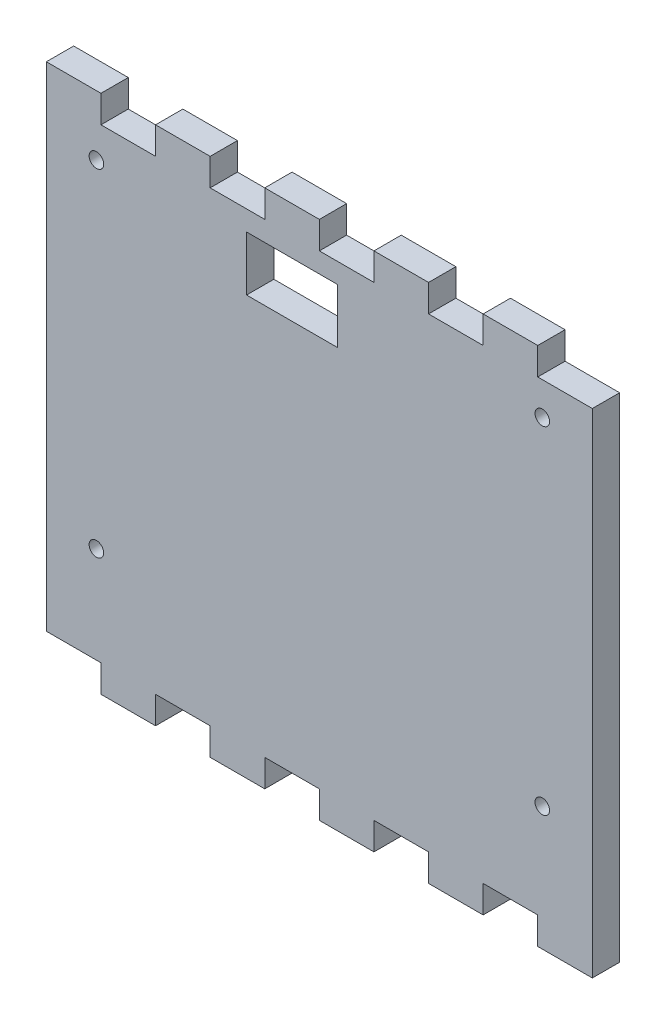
ISO-10303-21;
HEADER;
FILE_DESCRIPTION(('STEP AP214'),'2;1');
FILE_NAME('part.step','',(''),(''),'','','');
FILE_SCHEMA(('AUTOMOTIVE_DESIGN { 1 0 10303 214 1 1 1 1 }'));
ENDSEC;
DATA;
#1=APPLICATION_CONTEXT('core data for automotive mechanical design processes');
#2=APPLICATION_PROTOCOL_DEFINITION('international standard','automotive_design',2000,#1);
#3=PRODUCT_CONTEXT('',#1,'mechanical');
#4=PRODUCT('Part','Part','',(#3));
#5=PRODUCT_RELATED_PRODUCT_CATEGORY('part','',(#4));
#6=PRODUCT_DEFINITION_FORMATION('','',#4);
#7=PRODUCT_DEFINITION_CONTEXT('part definition',#1,'design');
#8=PRODUCT_DEFINITION('design','',#6,#7);
#9=PRODUCT_DEFINITION_SHAPE('','',#8);
#10=(LENGTH_UNIT() NAMED_UNIT(*) SI_UNIT(.MILLI.,.METRE.));
#11=(NAMED_UNIT(*) PLANE_ANGLE_UNIT() SI_UNIT($,.RADIAN.));
#12=(NAMED_UNIT(*) SI_UNIT($,.STERADIAN.) SOLID_ANGLE_UNIT());
#13=UNCERTAINTY_MEASURE_WITH_UNIT(LENGTH_MEASURE(1.E-05),#10,'distance_accuracy_value','');
#14=(GEOMETRIC_REPRESENTATION_CONTEXT(3) GLOBAL_UNCERTAINTY_ASSIGNED_CONTEXT((#13)) GLOBAL_UNIT_ASSIGNED_CONTEXT((#10,
#11,#12)) REPRESENTATION_CONTEXT('',''));
#15=CARTESIAN_POINT('',(0.,0.,0.));
#16=DIRECTION('',(0.,0.,1.));
#17=DIRECTION('',(1.,0.,0.));
#18=AXIS2_PLACEMENT_3D('',#15,#16,#17);
#19=CARTESIAN_POINT('',(0.,-286.,15.));
#20=DIRECTION('',(0.,1.,0.));
#21=DIRECTION('',(0.,0.,1.));
#22=AXIS2_PLACEMENT_3D('',#19,#20,#21);
#23=PLANE('',#22);
#24=DIRECTION('',(0.,0.,-1.));
#25=VECTOR('',#24,1.);
#26=CARTESIAN_POINT('',(180.,-286.,15.));
#27=LINE('',#26,#25);
#28=CARTESIAN_POINT('',(180.,-286.,15.));
#29=VERTEX_POINT('',#28);
#30=CARTESIAN_POINT('',(180.,-286.,0.));
#31=VERTEX_POINT('',#30);
#32=EDGE_CURVE('E369',#29,#31,#27,.T.);
#33=ORIENTED_EDGE('',*,*,#32,.F.);
#34=DIRECTION('',(1.,0.,0.));
#35=VECTOR('',#34,1.);
#36=CARTESIAN_POINT('',(0.,-286.,15.));
#37=LINE('',#36,#35);
#38=CARTESIAN_POINT('',(150.,-286.,15.));
#39=VERTEX_POINT('',#38);
#40=EDGE_CURVE('E583',#39,#29,#37,.T.);
#41=ORIENTED_EDGE('',*,*,#40,.F.);
#42=DIRECTION('',(0.,0.,-1.));
#43=VECTOR('',#42,1.);
#44=CARTESIAN_POINT('',(150.,-286.,15.));
#45=LINE('',#44,#43);
#46=CARTESIAN_POINT('',(150.,-286.,0.));
#47=VERTEX_POINT('',#46);
#48=EDGE_CURVE('E397',#39,#47,#45,.T.);
#49=ORIENTED_EDGE('',*,*,#48,.T.);
#50=DIRECTION('',(1.,0.,0.));
#51=VECTOR('',#50,1.);
#52=CARTESIAN_POINT('',(0.,-286.,0.));
#53=LINE('',#52,#51);
#54=EDGE_CURVE('E597',#47,#31,#53,.T.);
#55=ORIENTED_EDGE('',*,*,#54,.T.);
#56=EDGE_LOOP('',(#33,#41,#49,#55));
#57=FACE_BOUND('',#56,.T.);
#58=ADVANCED_FACE('F34',(#57),#23,.F.);
#59=DIRECTION('',(0.,0.,-1.));
#60=VECTOR('',#59,1.);
#61=CARTESIAN_POINT('',(210.,-286.,15.));
#62=LINE('',#61,#60);
#63=CARTESIAN_POINT('',(210.,-286.,15.));
#64=VERTEX_POINT('',#63);
#65=CARTESIAN_POINT('',(210.,-286.,0.));
#66=VERTEX_POINT('',#65);
#67=EDGE_CURVE('E372',#64,#66,#62,.T.);
#68=ORIENTED_EDGE('',*,*,#67,.T.);
#69=CARTESIAN_POINT('',(240.,-286.,0.));
#70=VERTEX_POINT('',#69);
#71=EDGE_CURVE('E595',#66,#70,#53,.T.);
#72=ORIENTED_EDGE('',*,*,#71,.T.);
#73=DIRECTION('',(0.,0.,-1.));
#74=VECTOR('',#73,1.);
#75=CARTESIAN_POINT('',(240.,-286.,15.));
#76=LINE('',#75,#74);
#77=CARTESIAN_POINT('',(240.,-286.,15.));
#78=VERTEX_POINT('',#77);
#79=EDGE_CURVE('E460',#78,#70,#76,.T.);
#80=ORIENTED_EDGE('',*,*,#79,.F.);
#81=EDGE_CURVE('E581',#64,#78,#37,.T.);
#82=ORIENTED_EDGE('',*,*,#81,.F.);
#83=EDGE_LOOP('',(#68,#72,#80,#82));
#84=FACE_BOUND('',#83,.T.);
#85=ADVANCED_FACE('F746',(#84),#23,.F.);
#86=DIRECTION('',(0.,0.,-1.));
#87=VECTOR('',#86,1.);
#88=CARTESIAN_POINT('',(120.,-286.,15.));
#89=LINE('',#88,#87);
#90=CARTESIAN_POINT('',(120.,-286.,15.));
#91=VERTEX_POINT('',#90);
#92=CARTESIAN_POINT('',(120.,-286.,0.));
#93=VERTEX_POINT('',#92);
#94=EDGE_CURVE('E364',#91,#93,#89,.T.);
#95=ORIENTED_EDGE('',*,*,#94,.F.);
#96=CARTESIAN_POINT('',(90.,-286.,15.));
#97=VERTEX_POINT('',#96);
#98=EDGE_CURVE('E775',#97,#91,#37,.T.);
#99=ORIENTED_EDGE('',*,*,#98,.F.);
#100=DIRECTION('',(0.,0.,-1.));
#101=VECTOR('',#100,1.);
#102=CARTESIAN_POINT('',(90.,-286.,15.));
#103=LINE('',#102,#101);
#104=CARTESIAN_POINT('',(90.,-286.,0.));
#105=VERTEX_POINT('',#104);
#106=EDGE_CURVE('E422',#97,#105,#103,.T.);
#107=ORIENTED_EDGE('',*,*,#106,.T.);
#108=EDGE_CURVE('E1128',#105,#93,#53,.T.);
#109=ORIENTED_EDGE('',*,*,#108,.T.);
#110=EDGE_LOOP('',(#95,#99,#107,#109));
#111=FACE_BOUND('',#110,.T.);
#112=ADVANCED_FACE('F751',(#111),#23,.F.);
#113=DIRECTION('',(0.,0.,-1.));
#114=VECTOR('',#113,1.);
#115=CARTESIAN_POINT('',(60.,-286.,15.));
#116=LINE('',#115,#114);
#117=CARTESIAN_POINT('',(60.,-286.,15.));
#118=VERTEX_POINT('',#117);
#119=CARTESIAN_POINT('',(60.,-286.,0.));
#120=VERTEX_POINT('',#119);
#121=EDGE_CURVE('E391',#118,#120,#116,.T.);
#122=ORIENTED_EDGE('',*,*,#121,.F.);
#123=CARTESIAN_POINT('',(30.,-286.,15.));
#124=VERTEX_POINT('',#123);
#125=EDGE_CURVE('E588',#124,#118,#37,.T.);
#126=ORIENTED_EDGE('',*,*,#125,.F.);
#127=DIRECTION('',(0.,0.,-1.));
#128=VECTOR('',#127,1.);
#129=CARTESIAN_POINT('',(30.,-286.,15.));
#130=LINE('',#129,#128);
#131=CARTESIAN_POINT('',(30.,-286.,0.));
#132=VERTEX_POINT('',#131);
#133=EDGE_CURVE('E416',#124,#132,#130,.T.);
#134=ORIENTED_EDGE('',*,*,#133,.T.);
#135=EDGE_CURVE('E602',#132,#120,#53,.T.);
#136=ORIENTED_EDGE('',*,*,#135,.T.);
#137=EDGE_LOOP('',(#122,#126,#134,#136));
#138=FACE_BOUND('',#137,.T.);
#139=ADVANCED_FACE('F756',(#138),#23,.F.);
#140=CARTESIAN_POINT('',(0.,0.,15.));
#141=DIRECTION('',(0.,0.,1.));
#142=DIRECTION('',(1.,0.,0.));
#143=AXIS2_PLACEMENT_3D('',#140,#141,#142);
#144=PLANE('',#143);
#145=DIRECTION('',(0.,-1.,0.));
#146=VECTOR('',#145,1.);
#147=CARTESIAN_POINT('',(160.,-26.,15.));
#148=LINE('',#147,#146);
#149=CARTESIAN_POINT('',(160.,-26.,15.));
#150=VERTEX_POINT('',#149);
#151=CARTESIAN_POINT('',(160.,-56.,15.));
#152=VERTEX_POINT('',#151);
#153=EDGE_CURVE('E317',#150,#152,#148,.T.);
#154=ORIENTED_EDGE('',*,*,#153,.T.);
#155=DIRECTION('',(-1.,0.,0.));
#156=VECTOR('',#155,1.);
#157=CARTESIAN_POINT('',(160.,-56.,15.));
#158=LINE('',#157,#156);
#159=CARTESIAN_POINT('',(110.,-56.,15.));
#160=VERTEX_POINT('',#159);
#161=EDGE_CURVE('E326',#152,#160,#158,.T.);
#162=ORIENTED_EDGE('',*,*,#161,.T.);
#163=DIRECTION('',(0.,1.,0.));
#164=VECTOR('',#163,1.);
#165=CARTESIAN_POINT('',(110.,-26.,15.));
#166=LINE('',#165,#164);
#167=CARTESIAN_POINT('',(110.,-26.,15.));
#168=VERTEX_POINT('',#167);
#169=EDGE_CURVE('E49',#160,#168,#166,.T.);
#170=ORIENTED_EDGE('',*,*,#169,.T.);
#171=DIRECTION('',(1.,0.,0.));
#172=VECTOR('',#171,1.);
#173=CARTESIAN_POINT('',(160.,-26.,15.));
#174=LINE('',#173,#172);
#175=EDGE_CURVE('E323',#168,#150,#174,.T.);
#176=ORIENTED_EDGE('',*,*,#175,.T.);
#177=EDGE_LOOP('',(#154,#162,#170,#176));
#178=FACE_BOUND('',#177,.T.);
#179=CARTESIAN_POINT('',(272.5,-33.,15.));
#180=DIRECTION('',(0.,0.,-1.));
#181=DIRECTION('',(-1.,0.,0.));
#182=AXIS2_PLACEMENT_3D('',#179,#180,#181);
#183=CIRCLE('',#182,3.99999999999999);
#184=CARTESIAN_POINT('',(268.5,-33.,15.));
#185=VERTEX_POINT('',#184);
#186=EDGE_CURVE('E484',#185,#185,#183,.T.);
#187=ORIENTED_EDGE('',*,*,#186,.T.);
#188=EDGE_LOOP('',(#187));
#189=FACE_BOUND('',#188,.T.);
#190=CARTESIAN_POINT('',(272.5,-218.,15.));
#191=DIRECTION('',(0.,0.,-1.));
#192=DIRECTION('',(-1.,0.,0.));
#193=AXIS2_PLACEMENT_3D('',#190,#191,#192);
#194=CIRCLE('',#193,3.99999999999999);
#195=CARTESIAN_POINT('',(268.5,-218.,15.));
#196=VERTEX_POINT('',#195);
#197=EDGE_CURVE('E478',#196,#196,#194,.T.);
#198=ORIENTED_EDGE('',*,*,#197,.T.);
#199=EDGE_LOOP('',(#198));
#200=FACE_BOUND('',#199,.T.);
#201=CARTESIAN_POINT('',(27.5,-218.,15.));
#202=DIRECTION('',(0.,0.,-1.));
#203=DIRECTION('',(-1.,0.,0.));
#204=AXIS2_PLACEMENT_3D('',#201,#202,#203);
#205=CIRCLE('',#204,4.);
#206=CARTESIAN_POINT('',(23.5,-218.,15.));
#207=VERTEX_POINT('',#206);
#208=EDGE_CURVE('E471',#207,#207,#205,.T.);
#209=ORIENTED_EDGE('',*,*,#208,.T.);
#210=EDGE_LOOP('',(#209));
#211=FACE_BOUND('',#210,.T.);
#212=CARTESIAN_POINT('',(27.5,-33.,15.));
#213=DIRECTION('',(0.,0.,-1.));
#214=DIRECTION('',(-1.,0.,0.));
#215=AXIS2_PLACEMENT_3D('',#212,#213,#214);
#216=CIRCLE('',#215,4.);
#217=CARTESIAN_POINT('',(23.5,-33.,15.));
#218=VERTEX_POINT('',#217);
#219=EDGE_CURVE('E489',#218,#218,#216,.T.);
#220=ORIENTED_EDGE('',*,*,#219,.T.);
#221=EDGE_LOOP('',(#220));
#222=FACE_BOUND('',#221,.T.);
#223=ORIENTED_EDGE('',*,*,#40,.T.);
#224=DIRECTION('',(0.,-1.,0.));
#225=VECTOR('',#224,1.);
#226=CARTESIAN_POINT('',(180.,0.,15.));
#227=LINE('',#226,#225);
#228=CARTESIAN_POINT('',(180.,-271.,15.));
#229=VERTEX_POINT('',#228);
#230=EDGE_CURVE('E352',#229,#29,#227,.T.);
#231=ORIENTED_EDGE('',*,*,#230,.F.);
#232=DIRECTION('',(-1.,0.,0.));
#233=VECTOR('',#232,1.);
#234=CARTESIAN_POINT('',(-60.,-271.,15.));
#235=LINE('',#234,#233);
#236=CARTESIAN_POINT('',(210.,-271.,15.));
#237=VERTEX_POINT('',#236);
#238=EDGE_CURVE('E354',#237,#229,#235,.T.);
#239=ORIENTED_EDGE('',*,*,#238,.F.);
#240=DIRECTION('',(0.,1.,0.));
#241=VECTOR('',#240,1.);
#242=CARTESIAN_POINT('',(210.,0.,15.));
#243=LINE('',#242,#241);
#244=EDGE_CURVE('E357',#64,#237,#243,.T.);
#245=ORIENTED_EDGE('',*,*,#244,.F.);
#246=ORIENTED_EDGE('',*,*,#81,.T.);
#247=DIRECTION('',(0.,-1.,0.));
#248=VECTOR('',#247,1.);
#249=CARTESIAN_POINT('',(240.,0.,15.));
#250=LINE('',#249,#248);
#251=CARTESIAN_POINT('',(240.,-271.,15.));
#252=VERTEX_POINT('',#251);
#253=EDGE_CURVE('E444',#252,#78,#250,.T.);
#254=ORIENTED_EDGE('',*,*,#253,.F.);
#255=DIRECTION('',(-1.,0.,0.));
#256=VECTOR('',#255,1.);
#257=CARTESIAN_POINT('',(0.,-271.,15.));
#258=LINE('',#257,#256);
#259=CARTESIAN_POINT('',(270.,-271.,15.));
#260=VERTEX_POINT('',#259);
#261=EDGE_CURVE('E447',#260,#252,#258,.T.);
#262=ORIENTED_EDGE('',*,*,#261,.F.);
#263=DIRECTION('',(0.,1.,0.));
#264=VECTOR('',#263,1.);
#265=CARTESIAN_POINT('',(270.,0.,15.));
#266=LINE('',#265,#264);
#267=CARTESIAN_POINT('',(270.,-286.,15.));
#268=VERTEX_POINT('',#267);
#269=EDGE_CURVE('E450',#268,#260,#266,.T.);
#270=ORIENTED_EDGE('',*,*,#269,.F.);
#271=CARTESIAN_POINT('',(300.,-286.,15.));
#272=VERTEX_POINT('',#271);
#273=EDGE_CURVE('E579',#268,#272,#37,.T.);
#274=ORIENTED_EDGE('',*,*,#273,.T.);
#275=DIRECTION('',(0.,1.,0.));
#276=VECTOR('',#275,1.);
#277=CARTESIAN_POINT('',(300.,0.,15.));
#278=LINE('',#277,#276);
#279=CARTESIAN_POINT('',(300.,-15.,15.));
#280=VERTEX_POINT('',#279);
#281=EDGE_CURVE('E584',#272,#280,#278,.T.);
#282=ORIENTED_EDGE('',*,*,#281,.T.);
#283=DIRECTION('',(1.,0.,0.));
#284=VECTOR('',#283,1.);
#285=CARTESIAN_POINT('',(270.,-15.,15.));
#286=LINE('',#285,#284);
#287=CARTESIAN_POINT('',(270.,-15.,15.));
#288=VERTEX_POINT('',#287);
#289=EDGE_CURVE('E550',#288,#280,#286,.T.);
#290=ORIENTED_EDGE('',*,*,#289,.F.);
#291=DIRECTION('',(0.,-1.,0.));
#292=VECTOR('',#291,1.);
#293=CARTESIAN_POINT('',(270.,0.,15.));
#294=LINE('',#293,#292);
#295=CARTESIAN_POINT('',(270.,0.,15.));
#296=VERTEX_POINT('',#295);
#297=EDGE_CURVE('E492',#296,#288,#294,.T.);
#298=ORIENTED_EDGE('',*,*,#297,.F.);
#299=DIRECTION('',(-1.,0.,0.));
#300=VECTOR('',#299,1.);
#301=CARTESIAN_POINT('',(0.,0.,15.));
#302=LINE('',#301,#300);
#303=CARTESIAN_POINT('',(240.,0.,15.));
#304=VERTEX_POINT('',#303);
#305=EDGE_CURVE('E610',#296,#304,#302,.T.);
#306=ORIENTED_EDGE('',*,*,#305,.T.);
#307=DIRECTION('',(0.,1.,0.));
#308=VECTOR('',#307,1.);
#309=CARTESIAN_POINT('',(240.,0.,15.));
#310=LINE('',#309,#308);
#311=CARTESIAN_POINT('',(240.,-15.,15.));
#312=VERTEX_POINT('',#311);
#313=EDGE_CURVE('E538',#312,#304,#310,.T.);
#314=ORIENTED_EDGE('',*,*,#313,.F.);
#315=DIRECTION('',(1.,0.,0.));
#316=VECTOR('',#315,1.);
#317=CARTESIAN_POINT('',(210.,-15.,15.));
#318=LINE('',#317,#316);
#319=CARTESIAN_POINT('',(210.,-15.,15.));
#320=VERTEX_POINT('',#319);
#321=EDGE_CURVE('E534',#320,#312,#318,.T.);
#322=ORIENTED_EDGE('',*,*,#321,.F.);
#323=DIRECTION('',(0.,-1.,0.));
#324=VECTOR('',#323,1.);
#325=CARTESIAN_POINT('',(210.,0.,15.));
#326=LINE('',#325,#324);
#327=CARTESIAN_POINT('',(210.,0.,15.));
#328=VERTEX_POINT('',#327);
#329=EDGE_CURVE('E531',#328,#320,#326,.T.);
#330=ORIENTED_EDGE('',*,*,#329,.F.);
#331=CARTESIAN_POINT('',(180.,0.,15.));
#332=VERTEX_POINT('',#331);
#333=EDGE_CURVE('E691',#328,#332,#302,.T.);
#334=ORIENTED_EDGE('',*,*,#333,.T.);
#335=DIRECTION('',(0.,1.,0.));
#336=VECTOR('',#335,1.);
#337=CARTESIAN_POINT('',(180.,0.,15.));
#338=LINE('',#337,#336);
#339=CARTESIAN_POINT('',(180.,-15.,15.));
#340=VERTEX_POINT('',#339);
#341=EDGE_CURVE('E521',#340,#332,#338,.T.);
#342=ORIENTED_EDGE('',*,*,#341,.F.);
#343=DIRECTION('',(1.,0.,0.));
#344=VECTOR('',#343,1.);
#345=CARTESIAN_POINT('',(150.,-15.,15.));
#346=LINE('',#345,#344);
#347=CARTESIAN_POINT('',(150.,-15.,15.));
#348=VERTEX_POINT('',#347);
#349=EDGE_CURVE('E517',#348,#340,#346,.T.);
#350=ORIENTED_EDGE('',*,*,#349,.F.);
#351=DIRECTION('',(0.,-1.,0.));
#352=VECTOR('',#351,1.);
#353=CARTESIAN_POINT('',(150.,0.,15.));
#354=LINE('',#353,#352);
#355=CARTESIAN_POINT('',(150.,0.,15.));
#356=VERTEX_POINT('',#355);
#357=EDGE_CURVE('E514',#356,#348,#354,.T.);
#358=ORIENTED_EDGE('',*,*,#357,.F.);
#359=CARTESIAN_POINT('',(120.,0.,15.));
#360=VERTEX_POINT('',#359);
#361=EDGE_CURVE('E591',#356,#360,#302,.T.);
#362=ORIENTED_EDGE('',*,*,#361,.T.);
#363=DIRECTION('',(0.,1.,0.));
#364=VECTOR('',#363,1.);
#365=CARTESIAN_POINT('',(120.,0.,15.));
#366=LINE('',#365,#364);
#367=CARTESIAN_POINT('',(120.,-14.9999999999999,15.));
#368=VERTEX_POINT('',#367);
#369=EDGE_CURVE('E502',#368,#360,#366,.T.);
#370=ORIENTED_EDGE('',*,*,#369,.F.);
#371=DIRECTION('',(1.,0.,0.));
#372=VECTOR('',#371,1.);
#373=CARTESIAN_POINT('',(90.,-15.,15.));
#374=LINE('',#373,#372);
#375=CARTESIAN_POINT('',(90.,-15.,15.));
#376=VERTEX_POINT('',#375);
#377=EDGE_CURVE('E498',#376,#368,#374,.T.);
#378=ORIENTED_EDGE('',*,*,#377,.F.);
#379=DIRECTION('',(0.,-1.,0.));
#380=VECTOR('',#379,1.);
#381=CARTESIAN_POINT('',(90.,0.,15.));
#382=LINE('',#381,#380);
#383=CARTESIAN_POINT('',(90.,0.,15.));
#384=VERTEX_POINT('',#383);
#385=EDGE_CURVE('E495',#384,#376,#382,.T.);
#386=ORIENTED_EDGE('',*,*,#385,.F.);
#387=CARTESIAN_POINT('',(60.,0.,15.));
#388=VERTEX_POINT('',#387);
#389=EDGE_CURVE('E589',#384,#388,#302,.T.);
#390=ORIENTED_EDGE('',*,*,#389,.T.);
#391=DIRECTION('',(0.,1.,0.));
#392=VECTOR('',#391,1.);
#393=CARTESIAN_POINT('',(60.,0.,15.));
#394=LINE('',#393,#392);
#395=CARTESIAN_POINT('',(60.,-14.9999999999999,15.));
#396=VERTEX_POINT('',#395);
#397=EDGE_CURVE('E563',#396,#388,#394,.T.);
#398=ORIENTED_EDGE('',*,*,#397,.F.);
#399=DIRECTION('',(1.,0.,0.));
#400=VECTOR('',#399,1.);
#401=CARTESIAN_POINT('',(30.,-15.,15.));
#402=LINE('',#401,#400);
#403=CARTESIAN_POINT('',(30.,-15.,15.));
#404=VERTEX_POINT('',#403);
#405=EDGE_CURVE('E560',#404,#396,#402,.T.);
#406=ORIENTED_EDGE('',*,*,#405,.F.);
#407=DIRECTION('',(0.,-1.,0.));
#408=VECTOR('',#407,1.);
#409=CARTESIAN_POINT('',(30.,0.,15.));
#410=LINE('',#409,#408);
#411=CARTESIAN_POINT('',(30.,0.,15.));
#412=VERTEX_POINT('',#411);
#413=EDGE_CURVE('E507',#412,#404,#410,.T.);
#414=ORIENTED_EDGE('',*,*,#413,.F.);
#415=CARTESIAN_POINT('',(0.,0.,15.));
#416=VERTEX_POINT('',#415);
#417=EDGE_CURVE('E587',#412,#416,#302,.T.);
#418=ORIENTED_EDGE('',*,*,#417,.T.);
#419=DIRECTION('',(0.,-1.,0.));
#420=VECTOR('',#419,1.);
#421=CARTESIAN_POINT('',(0.,0.,15.));
#422=LINE('',#421,#420);
#423=CARTESIAN_POINT('',(0.,-271.,15.));
#424=VERTEX_POINT('',#423);
#425=EDGE_CURVE('E576',#416,#424,#422,.T.);
#426=ORIENTED_EDGE('',*,*,#425,.T.);
#427=DIRECTION('',(-1.,0.,0.));
#428=VECTOR('',#427,1.);
#429=CARTESIAN_POINT('',(-240.,-271.,15.));
#430=LINE('',#429,#428);
#431=CARTESIAN_POINT('',(30.,-271.,15.));
#432=VERTEX_POINT('',#431);
#433=EDGE_CURVE('E429',#432,#424,#430,.T.);
#434=ORIENTED_EDGE('',*,*,#433,.F.);
#435=DIRECTION('',(0.,1.,0.));
#436=VECTOR('',#435,1.);
#437=CARTESIAN_POINT('',(30.,0.,15.));
#438=LINE('',#437,#436);
#439=EDGE_CURVE('E431',#124,#432,#438,.T.);
#440=ORIENTED_EDGE('',*,*,#439,.F.);
#441=ORIENTED_EDGE('',*,*,#125,.T.);
#442=DIRECTION('',(0.,-1.,0.));
#443=VECTOR('',#442,1.);
#444=CARTESIAN_POINT('',(60.,0.,15.));
#445=LINE('',#444,#443);
#446=CARTESIAN_POINT('',(60.,-271.,15.));
#447=VERTEX_POINT('',#446);
#448=EDGE_CURVE('E404',#447,#118,#445,.T.);
#449=ORIENTED_EDGE('',*,*,#448,.F.);
#450=DIRECTION('',(-1.,0.,0.));
#451=VECTOR('',#450,1.);
#452=CARTESIAN_POINT('',(-180.,-271.,15.));
#453=LINE('',#452,#451);
#454=CARTESIAN_POINT('',(90.,-271.,15.));
#455=VERTEX_POINT('',#454);
#456=EDGE_CURVE('E406',#455,#447,#453,.T.);
#457=ORIENTED_EDGE('',*,*,#456,.F.);
#458=DIRECTION('',(0.,1.,0.));
#459=VECTOR('',#458,1.);
#460=CARTESIAN_POINT('',(90.,0.,15.));
#461=LINE('',#460,#459);
#462=EDGE_CURVE('E409',#97,#455,#461,.T.);
#463=ORIENTED_EDGE('',*,*,#462,.F.);
#464=ORIENTED_EDGE('',*,*,#98,.T.);
#465=DIRECTION('',(0.,-1.,0.));
#466=VECTOR('',#465,1.);
#467=CARTESIAN_POINT('',(120.,0.,15.));
#468=LINE('',#467,#466);
#469=CARTESIAN_POINT('',(120.,-271.,15.));
#470=VERTEX_POINT('',#469);
#471=EDGE_CURVE('E379',#470,#91,#468,.T.);
#472=ORIENTED_EDGE('',*,*,#471,.F.);
#473=DIRECTION('',(-1.,0.,0.));
#474=VECTOR('',#473,1.);
#475=CARTESIAN_POINT('',(-120.,-271.,15.));
#476=LINE('',#475,#474);
#477=CARTESIAN_POINT('',(150.,-271.,15.));
#478=VERTEX_POINT('',#477);
#479=EDGE_CURVE('E381',#478,#470,#476,.T.);
#480=ORIENTED_EDGE('',*,*,#479,.F.);
#481=DIRECTION('',(0.,1.,0.));
#482=VECTOR('',#481,1.);
#483=CARTESIAN_POINT('',(150.,0.,15.));
#484=LINE('',#483,#482);
#485=EDGE_CURVE('E384',#39,#478,#484,.T.);
#486=ORIENTED_EDGE('',*,*,#485,.F.);
#487=EDGE_LOOP('',(#223,#231,#239,#245,#246,#254,#262,#270,#274,#282,#290,#298,#306,#314,#322,
#330,#334,#342,#350,#358,#362,#370,#378,#386,#390,#398,#406,#414,#418,#426,#434,#440,#441,#449,
#457,#463,#464,#472,#480,#486));
#488=FACE_BOUND('',#487,.T.);
#489=ADVANCED_FACE('F330',(#178,#189,#200,#211,#222,#488),#144,.T.);
#490=CARTESIAN_POINT('',(0.,0.,0.));
#491=DIRECTION('',(0.,0.,1.));
#492=DIRECTION('',(1.,0.,0.));
#493=AXIS2_PLACEMENT_3D('',#490,#491,#492);
#494=PLANE('',#493);
#495=DIRECTION('',(-1.,0.,0.));
#496=VECTOR('',#495,1.);
#497=CARTESIAN_POINT('',(160.,-56.,0.));
#498=LINE('',#497,#496);
#499=CARTESIAN_POINT('',(160.,-56.,0.));
#500=VERTEX_POINT('',#499);
#501=CARTESIAN_POINT('',(110.,-56.,0.));
#502=VERTEX_POINT('',#501);
#503=EDGE_CURVE('E342',#500,#502,#498,.T.);
#504=ORIENTED_EDGE('',*,*,#503,.F.);
#505=DIRECTION('',(0.,-1.,0.));
#506=VECTOR('',#505,1.);
#507=CARTESIAN_POINT('',(160.,-26.,0.));
#508=LINE('',#507,#506);
#509=CARTESIAN_POINT('',(160.,-26.,0.));
#510=VERTEX_POINT('',#509);
#511=EDGE_CURVE('E57',#510,#500,#508,.T.);
#512=ORIENTED_EDGE('',*,*,#511,.F.);
#513=DIRECTION('',(1.,0.,0.));
#514=VECTOR('',#513,1.);
#515=CARTESIAN_POINT('',(160.,-26.,0.));
#516=LINE('',#515,#514);
#517=CARTESIAN_POINT('',(110.,-26.,0.));
#518=VERTEX_POINT('',#517);
#519=EDGE_CURVE('E333',#518,#510,#516,.T.);
#520=ORIENTED_EDGE('',*,*,#519,.F.);
#521=DIRECTION('',(0.,1.,0.));
#522=VECTOR('',#521,1.);
#523=CARTESIAN_POINT('',(110.,-26.,0.));
#524=LINE('',#523,#522);
#525=EDGE_CURVE('E336',#502,#518,#524,.T.);
#526=ORIENTED_EDGE('',*,*,#525,.F.);
#527=EDGE_LOOP('',(#504,#512,#520,#526));
#528=FACE_BOUND('',#527,.T.);
#529=CARTESIAN_POINT('',(27.5,-33.,0.));
#530=DIRECTION('',(0.,0.,-1.));
#531=DIRECTION('',(-1.,0.,0.));
#532=AXIS2_PLACEMENT_3D('',#529,#530,#531);
#533=CIRCLE('',#532,4.);
#534=CARTESIAN_POINT('',(23.5,-33.,0.));
#535=VERTEX_POINT('',#534);
#536=EDGE_CURVE('E474',#535,#535,#533,.T.);
#537=ORIENTED_EDGE('',*,*,#536,.F.);
#538=EDGE_LOOP('',(#537));
#539=FACE_BOUND('',#538,.T.);
#540=CARTESIAN_POINT('',(27.5,-218.,0.));
#541=DIRECTION('',(0.,0.,-1.));
#542=DIRECTION('',(-1.,0.,0.));
#543=AXIS2_PLACEMENT_3D('',#540,#541,#542);
#544=CIRCLE('',#543,4.);
#545=CARTESIAN_POINT('',(23.5,-218.,0.));
#546=VERTEX_POINT('',#545);
#547=EDGE_CURVE('E475',#546,#546,#544,.T.);
#548=ORIENTED_EDGE('',*,*,#547,.F.);
#549=EDGE_LOOP('',(#548));
#550=FACE_BOUND('',#549,.T.);
#551=CARTESIAN_POINT('',(272.5,-218.,0.));
#552=DIRECTION('',(0.,0.,-1.));
#553=DIRECTION('',(-1.,0.,0.));
#554=AXIS2_PLACEMENT_3D('',#551,#552,#553);
#555=CIRCLE('',#554,3.99999999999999);
#556=CARTESIAN_POINT('',(268.5,-218.,0.));
#557=VERTEX_POINT('',#556);
#558=EDGE_CURVE('E481',#557,#557,#555,.T.);
#559=ORIENTED_EDGE('',*,*,#558,.F.);
#560=EDGE_LOOP('',(#559));
#561=FACE_BOUND('',#560,.T.);
#562=CARTESIAN_POINT('',(272.5,-33.,0.));
#563=DIRECTION('',(0.,0.,-1.));
#564=DIRECTION('',(-1.,0.,0.));
#565=AXIS2_PLACEMENT_3D('',#562,#563,#564);
#566=CIRCLE('',#565,3.99999999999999);
#567=CARTESIAN_POINT('',(268.5,-33.,0.));
#568=VERTEX_POINT('',#567);
#569=EDGE_CURVE('E463',#568,#568,#566,.T.);
#570=ORIENTED_EDGE('',*,*,#569,.F.);
#571=EDGE_LOOP('',(#570));
#572=FACE_BOUND('',#571,.T.);
#573=DIRECTION('',(0.,-1.,0.));
#574=VECTOR('',#573,1.);
#575=CARTESIAN_POINT('',(180.,0.,0.));
#576=LINE('',#575,#574);
#577=CARTESIAN_POINT('',(180.,-271.,0.));
#578=VERTEX_POINT('',#577);
#579=EDGE_CURVE('E360',#578,#31,#576,.T.);
#580=ORIENTED_EDGE('',*,*,#579,.T.);
#581=ORIENTED_EDGE('',*,*,#54,.F.);
#582=DIRECTION('',(0.,1.,0.));
#583=VECTOR('',#582,1.);
#584=CARTESIAN_POINT('',(150.,0.,0.));
#585=LINE('',#584,#583);
#586=CARTESIAN_POINT('',(150.,-271.,0.));
#587=VERTEX_POINT('',#586);
#588=EDGE_CURVE('E382',#47,#587,#585,.T.);
#589=ORIENTED_EDGE('',*,*,#588,.T.);
#590=DIRECTION('',(-1.,0.,0.));
#591=VECTOR('',#590,1.);
#592=CARTESIAN_POINT('',(-120.,-271.,0.));
#593=LINE('',#592,#591);
#594=CARTESIAN_POINT('',(120.,-271.,0.));
#595=VERTEX_POINT('',#594);
#596=EDGE_CURVE('E390',#587,#595,#593,.T.);
#597=ORIENTED_EDGE('',*,*,#596,.T.);
#598=DIRECTION('',(0.,-1.,0.));
#599=VECTOR('',#598,1.);
#600=CARTESIAN_POINT('',(120.,0.,0.));
#601=LINE('',#600,#599);
#602=EDGE_CURVE('E387',#595,#93,#601,.T.);
#603=ORIENTED_EDGE('',*,*,#602,.T.);
#604=ORIENTED_EDGE('',*,*,#108,.F.);
#605=DIRECTION('',(0.,1.,0.));
#606=VECTOR('',#605,1.);
#607=CARTESIAN_POINT('',(90.,0.,0.));
#608=LINE('',#607,#606);
#609=CARTESIAN_POINT('',(90.,-271.,0.));
#610=VERTEX_POINT('',#609);
#611=EDGE_CURVE('E407',#105,#610,#608,.T.);
#612=ORIENTED_EDGE('',*,*,#611,.T.);
#613=DIRECTION('',(-1.,0.,0.));
#614=VECTOR('',#613,1.);
#615=CARTESIAN_POINT('',(-180.,-271.,0.));
#616=LINE('',#615,#614);
#617=CARTESIAN_POINT('',(60.,-271.,0.));
#618=VERTEX_POINT('',#617);
#619=EDGE_CURVE('E415',#610,#618,#616,.T.);
#620=ORIENTED_EDGE('',*,*,#619,.T.);
#621=DIRECTION('',(0.,-1.,0.));
#622=VECTOR('',#621,1.);
#623=CARTESIAN_POINT('',(60.,0.,0.));
#624=LINE('',#623,#622);
#625=EDGE_CURVE('E412',#618,#120,#624,.T.);
#626=ORIENTED_EDGE('',*,*,#625,.T.);
#627=ORIENTED_EDGE('',*,*,#135,.F.);
#628=DIRECTION('',(0.,1.,0.));
#629=VECTOR('',#628,1.);
#630=CARTESIAN_POINT('',(30.,0.,0.));
#631=LINE('',#630,#629);
#632=CARTESIAN_POINT('',(30.,-271.,0.));
#633=VERTEX_POINT('',#632);
#634=EDGE_CURVE('E432',#132,#633,#631,.T.);
#635=ORIENTED_EDGE('',*,*,#634,.T.);
#636=DIRECTION('',(-1.,0.,0.));
#637=VECTOR('',#636,1.);
#638=CARTESIAN_POINT('',(-240.,-271.,0.));
#639=LINE('',#638,#637);
#640=CARTESIAN_POINT('',(0.,-271.,0.));
#641=VERTEX_POINT('',#640);
#642=EDGE_CURVE('E348',#633,#641,#639,.T.);
#643=ORIENTED_EDGE('',*,*,#642,.T.);
#644=DIRECTION('',(0.,-1.,0.));
#645=VECTOR('',#644,1.);
#646=CARTESIAN_POINT('',(0.,0.,0.));
#647=LINE('',#646,#645);
#648=CARTESIAN_POINT('',(0.,0.,0.));
#649=VERTEX_POINT('',#648);
#650=EDGE_CURVE('E569',#649,#641,#647,.T.);
#651=ORIENTED_EDGE('',*,*,#650,.F.);
#652=DIRECTION('',(-1.,0.,0.));
#653=VECTOR('',#652,1.);
#654=CARTESIAN_POINT('',(0.,0.,0.));
#655=LINE('',#654,#653);
#656=CARTESIAN_POINT('',(30.,0.,0.));
#657=VERTEX_POINT('',#656);
#658=EDGE_CURVE('E601',#657,#649,#655,.T.);
#659=ORIENTED_EDGE('',*,*,#658,.F.);
#660=DIRECTION('',(0.,-1.,0.));
#661=VECTOR('',#660,1.);
#662=CARTESIAN_POINT('',(30.,0.,0.));
#663=LINE('',#662,#661);
#664=CARTESIAN_POINT('',(30.,-15.,0.));
#665=VERTEX_POINT('',#664);
#666=EDGE_CURVE('E619',#657,#665,#663,.T.);
#667=ORIENTED_EDGE('',*,*,#666,.T.);
#668=DIRECTION('',(1.,0.,0.));
#669=VECTOR('',#668,1.);
#670=CARTESIAN_POINT('',(0.,-15.,0.));
#671=LINE('',#670,#669);
#672=CARTESIAN_POINT('',(60.,-14.9999999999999,0.));
#673=VERTEX_POINT('',#672);
#674=EDGE_CURVE('E613',#665,#673,#671,.T.);
#675=ORIENTED_EDGE('',*,*,#674,.T.);
#676=DIRECTION('',(0.,1.,0.));
#677=VECTOR('',#676,1.);
#678=CARTESIAN_POINT('',(60.,0.,0.));
#679=LINE('',#678,#677);
#680=CARTESIAN_POINT('',(60.,0.,0.));
#681=VERTEX_POINT('',#680);
#682=EDGE_CURVE('E616',#673,#681,#679,.T.);
#683=ORIENTED_EDGE('',*,*,#682,.T.);
#684=CARTESIAN_POINT('',(90.,0.,0.));
#685=VERTEX_POINT('',#684);
#686=EDGE_CURVE('E603',#685,#681,#655,.T.);
#687=ORIENTED_EDGE('',*,*,#686,.F.);
#688=DIRECTION('',(0.,-1.,0.));
#689=VECTOR('',#688,1.);
#690=CARTESIAN_POINT('',(90.,0.,0.));
#691=LINE('',#690,#689);
#692=CARTESIAN_POINT('',(90.,-15.,0.));
#693=VERTEX_POINT('',#692);
#694=EDGE_CURVE('E11',#685,#693,#691,.T.);
#695=ORIENTED_EDGE('',*,*,#694,.T.);
#696=DIRECTION('',(1.,0.,0.));
#697=VECTOR('',#696,1.);
#698=CARTESIAN_POINT('',(0.,-15.0000000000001,0.));
#699=LINE('',#698,#697);
#700=CARTESIAN_POINT('',(120.,-14.9999999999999,0.));
#701=VERTEX_POINT('',#700);
#702=EDGE_CURVE('E646',#693,#701,#699,.T.);
#703=ORIENTED_EDGE('',*,*,#702,.T.);
#704=DIRECTION('',(0.,1.,0.));
#705=VECTOR('',#704,1.);
#706=CARTESIAN_POINT('',(120.,0.,0.));
#707=LINE('',#706,#705);
#708=CARTESIAN_POINT('',(120.,0.,0.));
#709=VERTEX_POINT('',#708);
#710=EDGE_CURVE('E42',#701,#709,#707,.T.);
#711=ORIENTED_EDGE('',*,*,#710,.T.);
#712=CARTESIAN_POINT('',(150.,0.,0.));
#713=VERTEX_POINT('',#712);
#714=EDGE_CURVE('E605',#713,#709,#655,.T.);
#715=ORIENTED_EDGE('',*,*,#714,.F.);
#716=DIRECTION('',(0.,-1.,0.));
#717=VECTOR('',#716,1.);
#718=CARTESIAN_POINT('',(150.,1.04083408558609E-13,0.));
#719=LINE('',#718,#717);
#720=CARTESIAN_POINT('',(150.,-15.,0.));
#721=VERTEX_POINT('',#720);
#722=EDGE_CURVE('E643',#713,#721,#719,.T.);
#723=ORIENTED_EDGE('',*,*,#722,.T.);
#724=DIRECTION('',(1.,0.,0.));
#725=VECTOR('',#724,1.);
#726=CARTESIAN_POINT('',(0.,-15.0000000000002,0.));
#727=LINE('',#726,#725);
#728=CARTESIAN_POINT('',(180.,-15.,0.));
#729=VERTEX_POINT('',#728);
#730=EDGE_CURVE('E637',#721,#729,#727,.T.);
#731=ORIENTED_EDGE('',*,*,#730,.T.);
#732=DIRECTION('',(0.,1.,0.));
#733=VECTOR('',#732,1.);
#734=CARTESIAN_POINT('',(180.,0.,0.));
#735=LINE('',#734,#733);
#736=CARTESIAN_POINT('',(180.,0.,0.));
#737=VERTEX_POINT('',#736);
#738=EDGE_CURVE('E640',#729,#737,#735,.T.);
#739=ORIENTED_EDGE('',*,*,#738,.T.);
#740=CARTESIAN_POINT('',(210.,0.,0.));
#741=VERTEX_POINT('',#740);
#742=EDGE_CURVE('E660',#741,#737,#655,.T.);
#743=ORIENTED_EDGE('',*,*,#742,.F.);
#744=DIRECTION('',(0.,-1.,0.));
#745=VECTOR('',#744,1.);
#746=CARTESIAN_POINT('',(210.,1.45716771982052E-13,0.));
#747=LINE('',#746,#745);
#748=CARTESIAN_POINT('',(210.,-15.,0.));
#749=VERTEX_POINT('',#748);
#750=EDGE_CURVE('E634',#741,#749,#747,.T.);
#751=ORIENTED_EDGE('',*,*,#750,.T.);
#752=DIRECTION('',(1.,0.,0.));
#753=VECTOR('',#752,1.);
#754=CARTESIAN_POINT('',(0.,-15.0000000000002,0.));
#755=LINE('',#754,#753);
#756=CARTESIAN_POINT('',(240.,-15.,0.));
#757=VERTEX_POINT('',#756);
#758=EDGE_CURVE('E628',#749,#757,#755,.T.);
#759=ORIENTED_EDGE('',*,*,#758,.T.);
#760=DIRECTION('',(0.,1.,0.));
#761=VECTOR('',#760,1.);
#762=CARTESIAN_POINT('',(240.,1.11022302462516E-13,0.));
#763=LINE('',#762,#761);
#764=CARTESIAN_POINT('',(240.,0.,0.));
#765=VERTEX_POINT('',#764);
#766=EDGE_CURVE('E631',#757,#765,#763,.T.);
#767=ORIENTED_EDGE('',*,*,#766,.T.);
#768=CARTESIAN_POINT('',(270.,0.,0.));
#769=VERTEX_POINT('',#768);
#770=EDGE_CURVE('E580',#769,#765,#655,.T.);
#771=ORIENTED_EDGE('',*,*,#770,.F.);
#772=DIRECTION('',(0.,-1.,0.));
#773=VECTOR('',#772,1.);
#774=CARTESIAN_POINT('',(270.,1.87350135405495E-13,0.));
#775=LINE('',#774,#773);
#776=CARTESIAN_POINT('',(270.,-15.,0.));
#777=VERTEX_POINT('',#776);
#778=EDGE_CURVE('E625',#769,#777,#775,.T.);
#779=ORIENTED_EDGE('',*,*,#778,.T.);
#780=DIRECTION('',(1.,0.,0.));
#781=VECTOR('',#780,1.);
#782=CARTESIAN_POINT('',(0.,-15.0000000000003,0.));
#783=LINE('',#782,#781);
#784=CARTESIAN_POINT('',(300.,-15.,0.));
#785=VERTEX_POINT('',#784);
#786=EDGE_CURVE('E622',#777,#785,#783,.T.);
#787=ORIENTED_EDGE('',*,*,#786,.T.);
#788=DIRECTION('',(0.,1.,0.));
#789=VECTOR('',#788,1.);
#790=CARTESIAN_POINT('',(300.,0.,0.));
#791=LINE('',#790,#789);
#792=CARTESIAN_POINT('',(300.,-286.,0.));
#793=VERTEX_POINT('',#792);
#794=EDGE_CURVE('E598',#793,#785,#791,.T.);
#795=ORIENTED_EDGE('',*,*,#794,.F.);
#796=CARTESIAN_POINT('',(270.,-286.,0.));
#797=VERTEX_POINT('',#796);
#798=EDGE_CURVE('E594',#797,#793,#53,.T.);
#799=ORIENTED_EDGE('',*,*,#798,.F.);
#800=DIRECTION('',(0.,1.,0.));
#801=VECTOR('',#800,1.);
#802=CARTESIAN_POINT('',(270.,0.,0.));
#803=LINE('',#802,#801);
#804=CARTESIAN_POINT('',(270.,-271.,0.));
#805=VERTEX_POINT('',#804);
#806=EDGE_CURVE('E448',#797,#805,#803,.T.);
#807=ORIENTED_EDGE('',*,*,#806,.T.);
#808=DIRECTION('',(-1.,0.,0.));
#809=VECTOR('',#808,1.);
#810=CARTESIAN_POINT('',(0.,-271.,0.));
#811=LINE('',#810,#809);
#812=CARTESIAN_POINT('',(240.,-271.,0.));
#813=VERTEX_POINT('',#812);
#814=EDGE_CURVE('E455',#805,#813,#811,.T.);
#815=ORIENTED_EDGE('',*,*,#814,.T.);
#816=DIRECTION('',(0.,-1.,0.));
#817=VECTOR('',#816,1.);
#818=CARTESIAN_POINT('',(240.,0.,0.));
#819=LINE('',#818,#817);
#820=EDGE_CURVE('E371',#813,#70,#819,.T.);
#821=ORIENTED_EDGE('',*,*,#820,.T.);
#822=ORIENTED_EDGE('',*,*,#71,.F.);
#823=DIRECTION('',(0.,1.,0.));
#824=VECTOR('',#823,1.);
#825=CARTESIAN_POINT('',(210.,0.,0.));
#826=LINE('',#825,#824);
#827=CARTESIAN_POINT('',(210.,-271.,0.));
#828=VERTEX_POINT('',#827);
#829=EDGE_CURVE('E355',#66,#828,#826,.T.);
#830=ORIENTED_EDGE('',*,*,#829,.T.);
#831=DIRECTION('',(-1.,0.,0.));
#832=VECTOR('',#831,1.);
#833=CARTESIAN_POINT('',(-60.,-271.,0.));
#834=LINE('',#833,#832);
#835=EDGE_CURVE('E363',#828,#578,#834,.T.);
#836=ORIENTED_EDGE('',*,*,#835,.T.);
#837=EDGE_LOOP('',(#580,#581,#589,#597,#603,#604,#612,#620,#626,#627,#635,#643,#651,#659,#667,
#675,#683,#687,#695,#703,#711,#715,#723,#731,#739,#743,#751,#759,#767,#771,#779,#787,#795,#799,
#807,#815,#821,#822,#830,#836));
#838=FACE_BOUND('',#837,.T.);
#839=ADVANCED_FACE('F653',(#528,#539,#550,#561,#572,#838),#494,.F.);
#840=CARTESIAN_POINT('',(0.,0.,15.));
#841=DIRECTION('',(1.,0.,0.));
#842=DIRECTION('',(0.,1.,0.));
#843=AXIS2_PLACEMENT_3D('',#840,#841,#842);
#844=PLANE('',#843);
#845=DIRECTION('',(0.,0.,-1.));
#846=VECTOR('',#845,1.);
#847=CARTESIAN_POINT('',(0.,-271.,15.));
#848=LINE('',#847,#846);
#849=EDGE_CURVE('E434',#424,#641,#848,.T.);
#850=ORIENTED_EDGE('',*,*,#849,.F.);
#851=ORIENTED_EDGE('',*,*,#425,.F.);
#852=DIRECTION('',(0.,0.,-1.));
#853=VECTOR('',#852,1.);
#854=CARTESIAN_POINT('',(0.,0.,15.));
#855=LINE('',#854,#853);
#856=EDGE_CURVE('E606',#416,#649,#855,.T.);
#857=ORIENTED_EDGE('',*,*,#856,.T.);
#858=ORIENTED_EDGE('',*,*,#650,.T.);
#859=EDGE_LOOP('',(#850,#851,#857,#858));
#860=FACE_BOUND('',#859,.T.);
#861=ADVANCED_FACE('F36',(#860),#844,.F.);
#862=DIRECTION('',(0.,0.,-1.));
#863=VECTOR('',#862,1.);
#864=CARTESIAN_POINT('',(270.,-286.,15.));
#865=LINE('',#864,#863);
#866=EDGE_CURVE('E464',#268,#797,#865,.T.);
#867=ORIENTED_EDGE('',*,*,#866,.T.);
#868=ORIENTED_EDGE('',*,*,#798,.T.);
#869=DIRECTION('',(0.,0.,-1.));
#870=VECTOR('',#869,1.);
#871=CARTESIAN_POINT('',(300.,-286.,15.));
#872=LINE('',#871,#870);
#873=EDGE_CURVE('E609',#272,#793,#872,.T.);
#874=ORIENTED_EDGE('',*,*,#873,.F.);
#875=ORIENTED_EDGE('',*,*,#273,.F.);
#876=EDGE_LOOP('',(#867,#868,#874,#875));
#877=FACE_BOUND('',#876,.T.);
#878=ADVANCED_FACE('F742',(#877),#23,.F.);
#879=CARTESIAN_POINT('',(0.,0.,15.));
#880=DIRECTION('',(0.,-1.,0.));
#881=DIRECTION('',(0.,0.,-1.));
#882=AXIS2_PLACEMENT_3D('',#879,#880,#881);
#883=PLANE('',#882);
#884=ORIENTED_EDGE('',*,*,#389,.F.);
#885=DIRECTION('',(0.,0.,1.));
#886=VECTOR('',#885,1.);
#887=CARTESIAN_POINT('',(90.,0.,-26.));
#888=LINE('',#887,#886);
#889=EDGE_CURVE('E505',#685,#384,#888,.T.);
#890=ORIENTED_EDGE('',*,*,#889,.F.);
#891=ORIENTED_EDGE('',*,*,#686,.T.);
#892=DIRECTION('',(0.,0.,1.));
#893=VECTOR('',#892,1.);
#894=CARTESIAN_POINT('',(60.,0.,-26.));
#895=LINE('',#894,#893);
#896=EDGE_CURVE('E570',#681,#388,#895,.T.);
#897=ORIENTED_EDGE('',*,*,#896,.T.);
#898=EDGE_LOOP('',(#884,#890,#891,#897));
#899=FACE_BOUND('',#898,.T.);
#900=ADVANCED_FACE('F730',(#899),#883,.F.);
#901=ORIENTED_EDGE('',*,*,#714,.T.);
#902=DIRECTION('',(0.,0.,1.));
#903=VECTOR('',#902,1.);
#904=CARTESIAN_POINT('',(120.,0.,-26.));
#905=LINE('',#904,#903);
#906=EDGE_CURVE('E508',#709,#360,#905,.T.);
#907=ORIENTED_EDGE('',*,*,#906,.T.);
#908=ORIENTED_EDGE('',*,*,#361,.F.);
#909=DIRECTION('',(0.,0.,1.));
#910=VECTOR('',#909,1.);
#911=CARTESIAN_POINT('',(150.,0.,-26.));
#912=LINE('',#911,#910);
#913=EDGE_CURVE('E499',#713,#356,#912,.T.);
#914=ORIENTED_EDGE('',*,*,#913,.F.);
#915=EDGE_LOOP('',(#901,#907,#908,#914));
#916=FACE_BOUND('',#915,.T.);
#917=ADVANCED_FACE('F657',(#916),#883,.F.);
#918=ORIENTED_EDGE('',*,*,#742,.T.);
#919=DIRECTION('',(0.,0.,1.));
#920=VECTOR('',#919,1.);
#921=CARTESIAN_POINT('',(180.,0.,-26.));
#922=LINE('',#921,#920);
#923=EDGE_CURVE('E525',#737,#332,#922,.T.);
#924=ORIENTED_EDGE('',*,*,#923,.T.);
#925=ORIENTED_EDGE('',*,*,#333,.F.);
#926=DIRECTION('',(0.,0.,1.));
#927=VECTOR('',#926,1.);
#928=CARTESIAN_POINT('',(210.,0.,-26.));
#929=LINE('',#928,#927);
#930=EDGE_CURVE('E518',#741,#328,#929,.T.);
#931=ORIENTED_EDGE('',*,*,#930,.F.);
#932=EDGE_LOOP('',(#918,#924,#925,#931));
#933=FACE_BOUND('',#932,.T.);
#934=ADVANCED_FACE('F711',(#933),#883,.F.);
#935=ORIENTED_EDGE('',*,*,#417,.F.);
#936=DIRECTION('',(0.,0.,1.));
#937=VECTOR('',#936,1.);
#938=CARTESIAN_POINT('',(30.,0.,-26.));
#939=LINE('',#938,#937);
#940=EDGE_CURVE('E567',#657,#412,#939,.T.);
#941=ORIENTED_EDGE('',*,*,#940,.F.);
#942=ORIENTED_EDGE('',*,*,#658,.T.);
#943=ORIENTED_EDGE('',*,*,#856,.F.);
#944=EDGE_LOOP('',(#935,#941,#942,#943));
#945=FACE_BOUND('',#944,.T.);
#946=ADVANCED_FACE('F674',(#945),#883,.F.);
#947=CARTESIAN_POINT('',(300.,0.,15.));
#948=DIRECTION('',(-1.,0.,0.));
#949=DIRECTION('',(0.,0.,1.));
#950=AXIS2_PLACEMENT_3D('',#947,#948,#949);
#951=PLANE('',#950);
#952=ORIENTED_EDGE('',*,*,#794,.T.);
#953=DIRECTION('',(0.,0.,1.));
#954=VECTOR('',#953,1.);
#955=CARTESIAN_POINT('',(300.,-15.,-26.));
#956=LINE('',#955,#954);
#957=EDGE_CURVE('E554',#785,#280,#956,.T.);
#958=ORIENTED_EDGE('',*,*,#957,.T.);
#959=ORIENTED_EDGE('',*,*,#281,.F.);
#960=ORIENTED_EDGE('',*,*,#873,.T.);
#961=EDGE_LOOP('',(#952,#958,#959,#960));
#962=FACE_BOUND('',#961,.T.);
#963=ADVANCED_FACE('F728',(#962),#951,.F.);
#964=ORIENTED_EDGE('',*,*,#770,.T.);
#965=DIRECTION('',(0.,0.,1.));
#966=VECTOR('',#965,1.);
#967=CARTESIAN_POINT('',(240.,0.,-26.));
#968=LINE('',#967,#966);
#969=EDGE_CURVE('E542',#765,#304,#968,.T.);
#970=ORIENTED_EDGE('',*,*,#969,.T.);
#971=ORIENTED_EDGE('',*,*,#305,.F.);
#972=DIRECTION('',(0.,0.,1.));
#973=VECTOR('',#972,1.);
#974=CARTESIAN_POINT('',(270.,0.,-26.));
#975=LINE('',#974,#973);
#976=EDGE_CURVE('E535',#769,#296,#975,.T.);
#977=ORIENTED_EDGE('',*,*,#976,.F.);
#978=EDGE_LOOP('',(#964,#970,#971,#977));
#979=FACE_BOUND('',#978,.T.);
#980=ADVANCED_FACE('F725',(#979),#883,.F.);
#981=CARTESIAN_POINT('',(30.,0.,-26.));
#982=DIRECTION('',(-1.,0.,0.));
#983=DIRECTION('',(0.,-1.,0.));
#984=AXIS2_PLACEMENT_3D('',#981,#982,#983);
#985=PLANE('',#984);
#986=ORIENTED_EDGE('',*,*,#940,.T.);
#987=ORIENTED_EDGE('',*,*,#413,.T.);
#988=DIRECTION('',(0.,0.,1.));
#989=VECTOR('',#988,1.);
#990=CARTESIAN_POINT('',(30.,-15.,-26.));
#991=LINE('',#990,#989);
#992=EDGE_CURVE('E566',#665,#404,#991,.T.);
#993=ORIENTED_EDGE('',*,*,#992,.F.);
#994=ORIENTED_EDGE('',*,*,#666,.F.);
#995=EDGE_LOOP('',(#986,#987,#993,#994));
#996=FACE_BOUND('',#995,.T.);
#997=ADVANCED_FACE('F727',(#996),#985,.F.);
#998=CARTESIAN_POINT('',(60.,0.,-26.));
#999=DIRECTION('',(1.,0.,0.));
#1000=DIRECTION('',(0.,1.,0.));
#1001=AXIS2_PLACEMENT_3D('',#998,#999,#1000);
#1002=PLANE('',#1001);
#1003=DIRECTION('',(0.,0.,1.));
#1004=VECTOR('',#1003,1.);
#1005=CARTESIAN_POINT('',(60.,-14.9999999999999,-26.));
#1006=LINE('',#1005,#1004);
#1007=EDGE_CURVE('E573',#673,#396,#1006,.T.);
#1008=ORIENTED_EDGE('',*,*,#1007,.T.);
#1009=ORIENTED_EDGE('',*,*,#397,.T.);
#1010=ORIENTED_EDGE('',*,*,#896,.F.);
#1011=ORIENTED_EDGE('',*,*,#682,.F.);
#1012=EDGE_LOOP('',(#1008,#1009,#1010,#1011));
#1013=FACE_BOUND('',#1012,.T.);
#1014=ADVANCED_FACE('F735',(#1013),#1002,.F.);
#1015=CARTESIAN_POINT('',(30.,-15.,-26.));
#1016=DIRECTION('',(0.,-1.,0.));
#1017=DIRECTION('',(1.,0.,0.));
#1018=AXIS2_PLACEMENT_3D('',#1015,#1016,#1017);
#1019=PLANE('',#1018);
#1020=ORIENTED_EDGE('',*,*,#992,.T.);
#1021=ORIENTED_EDGE('',*,*,#405,.T.);
#1022=ORIENTED_EDGE('',*,*,#1007,.F.);
#1023=ORIENTED_EDGE('',*,*,#674,.F.);
#1024=EDGE_LOOP('',(#1020,#1021,#1022,#1023));
#1025=FACE_BOUND('',#1024,.T.);
#1026=ADVANCED_FACE('F793',(#1025),#1019,.F.);
#1027=CARTESIAN_POINT('',(270.,0.,-26.));
#1028=DIRECTION('',(-1.,0.,0.));
#1029=DIRECTION('',(0.,-1.,0.));
#1030=AXIS2_PLACEMENT_3D('',#1027,#1028,#1029);
#1031=PLANE('',#1030);
#1032=ORIENTED_EDGE('',*,*,#976,.T.);
#1033=ORIENTED_EDGE('',*,*,#297,.T.);
#1034=DIRECTION('',(0.,0.,1.));
#1035=VECTOR('',#1034,1.);
#1036=CARTESIAN_POINT('',(270.,-15.,-26.));
#1037=LINE('',#1036,#1035);
#1038=EDGE_CURVE('E552',#777,#288,#1037,.T.);
#1039=ORIENTED_EDGE('',*,*,#1038,.F.);
#1040=ORIENTED_EDGE('',*,*,#778,.F.);
#1041=EDGE_LOOP('',(#1032,#1033,#1039,#1040));
#1042=FACE_BOUND('',#1041,.T.);
#1043=ADVANCED_FACE('F724',(#1042),#1031,.F.);
#1044=CARTESIAN_POINT('',(270.,-15.,-26.));
#1045=DIRECTION('',(0.,-1.,0.));
#1046=DIRECTION('',(1.,0.,0.));
#1047=AXIS2_PLACEMENT_3D('',#1044,#1045,#1046);
#1048=PLANE('',#1047);
#1049=ORIENTED_EDGE('',*,*,#1038,.T.);
#1050=ORIENTED_EDGE('',*,*,#289,.T.);
#1051=ORIENTED_EDGE('',*,*,#957,.F.);
#1052=ORIENTED_EDGE('',*,*,#786,.F.);
#1053=EDGE_LOOP('',(#1049,#1050,#1051,#1052));
#1054=FACE_BOUND('',#1053,.T.);
#1055=ADVANCED_FACE('F785',(#1054),#1048,.F.);
#1056=CARTESIAN_POINT('',(210.,0.,-26.));
#1057=DIRECTION('',(-1.,0.,0.));
#1058=DIRECTION('',(0.,-1.,0.));
#1059=AXIS2_PLACEMENT_3D('',#1056,#1057,#1058);
#1060=PLANE('',#1059);
#1061=ORIENTED_EDGE('',*,*,#930,.T.);
#1062=ORIENTED_EDGE('',*,*,#329,.T.);
#1063=DIRECTION('',(0.,0.,1.));
#1064=VECTOR('',#1063,1.);
#1065=CARTESIAN_POINT('',(210.,-15.,-26.));
#1066=LINE('',#1065,#1064);
#1067=EDGE_CURVE('E540',#749,#320,#1066,.T.);
#1068=ORIENTED_EDGE('',*,*,#1067,.F.);
#1069=ORIENTED_EDGE('',*,*,#750,.F.);
#1070=EDGE_LOOP('',(#1061,#1062,#1068,#1069));
#1071=FACE_BOUND('',#1070,.T.);
#1072=ADVANCED_FACE('F714',(#1071),#1060,.F.);
#1073=CARTESIAN_POINT('',(240.,0.,-26.));
#1074=DIRECTION('',(1.,0.,0.));
#1075=DIRECTION('',(0.,1.,0.));
#1076=AXIS2_PLACEMENT_3D('',#1073,#1074,#1075);
#1077=PLANE('',#1076);
#1078=DIRECTION('',(0.,0.,1.));
#1079=VECTOR('',#1078,1.);
#1080=CARTESIAN_POINT('',(240.,-15.,-26.));
#1081=LINE('',#1080,#1079);
#1082=EDGE_CURVE('E545',#757,#312,#1081,.T.);
#1083=ORIENTED_EDGE('',*,*,#1082,.T.);
#1084=ORIENTED_EDGE('',*,*,#313,.T.);
#1085=ORIENTED_EDGE('',*,*,#969,.F.);
#1086=ORIENTED_EDGE('',*,*,#766,.F.);
#1087=EDGE_LOOP('',(#1083,#1084,#1085,#1086));
#1088=FACE_BOUND('',#1087,.T.);
#1089=ADVANCED_FACE('F720',(#1088),#1077,.F.);
#1090=CARTESIAN_POINT('',(210.,-15.,-26.));
#1091=DIRECTION('',(0.,-1.,0.));
#1092=DIRECTION('',(1.,0.,0.));
#1093=AXIS2_PLACEMENT_3D('',#1090,#1091,#1092);
#1094=PLANE('',#1093);
#1095=ORIENTED_EDGE('',*,*,#1067,.T.);
#1096=ORIENTED_EDGE('',*,*,#321,.T.);
#1097=ORIENTED_EDGE('',*,*,#1082,.F.);
#1098=ORIENTED_EDGE('',*,*,#758,.F.);
#1099=EDGE_LOOP('',(#1095,#1096,#1097,#1098));
#1100=FACE_BOUND('',#1099,.T.);
#1101=ADVANCED_FACE('F717',(#1100),#1094,.F.);
#1102=CARTESIAN_POINT('',(150.,0.,-26.));
#1103=DIRECTION('',(-1.,0.,0.));
#1104=DIRECTION('',(0.,-1.,0.));
#1105=AXIS2_PLACEMENT_3D('',#1102,#1103,#1104);
#1106=PLANE('',#1105);
#1107=ORIENTED_EDGE('',*,*,#913,.T.);
#1108=ORIENTED_EDGE('',*,*,#357,.T.);
#1109=DIRECTION('',(0.,0.,1.));
#1110=VECTOR('',#1109,1.);
#1111=CARTESIAN_POINT('',(150.,-15.,-26.));
#1112=LINE('',#1111,#1110);
#1113=EDGE_CURVE('E523',#721,#348,#1112,.T.);
#1114=ORIENTED_EDGE('',*,*,#1113,.F.);
#1115=ORIENTED_EDGE('',*,*,#722,.F.);
#1116=EDGE_LOOP('',(#1107,#1108,#1114,#1115));
#1117=FACE_BOUND('',#1116,.T.);
#1118=ADVANCED_FACE('F705',(#1117),#1106,.F.);
#1119=CARTESIAN_POINT('',(180.,0.,-26.));
#1120=DIRECTION('',(1.,0.,0.));
#1121=DIRECTION('',(0.,1.,0.));
#1122=AXIS2_PLACEMENT_3D('',#1119,#1120,#1121);
#1123=PLANE('',#1122);
#1124=DIRECTION('',(0.,0.,1.));
#1125=VECTOR('',#1124,1.);
#1126=CARTESIAN_POINT('',(180.,-15.,-26.));
#1127=LINE('',#1126,#1125);
#1128=EDGE_CURVE('E528',#729,#340,#1127,.T.);
#1129=ORIENTED_EDGE('',*,*,#1128,.T.);
#1130=ORIENTED_EDGE('',*,*,#341,.T.);
#1131=ORIENTED_EDGE('',*,*,#923,.F.);
#1132=ORIENTED_EDGE('',*,*,#738,.F.);
#1133=EDGE_LOOP('',(#1129,#1130,#1131,#1132));
#1134=FACE_BOUND('',#1133,.T.);
#1135=ADVANCED_FACE('F710',(#1134),#1123,.F.);
#1136=CARTESIAN_POINT('',(150.,-15.,-26.));
#1137=DIRECTION('',(0.,-1.,0.));
#1138=DIRECTION('',(1.,0.,0.));
#1139=AXIS2_PLACEMENT_3D('',#1136,#1137,#1138);
#1140=PLANE('',#1139);
#1141=ORIENTED_EDGE('',*,*,#1113,.T.);
#1142=ORIENTED_EDGE('',*,*,#349,.T.);
#1143=ORIENTED_EDGE('',*,*,#1128,.F.);
#1144=ORIENTED_EDGE('',*,*,#730,.F.);
#1145=EDGE_LOOP('',(#1141,#1142,#1143,#1144));
#1146=FACE_BOUND('',#1145,.T.);
#1147=ADVANCED_FACE('F708',(#1146),#1140,.F.);
#1148=CARTESIAN_POINT('',(90.,0.,-26.));
#1149=DIRECTION('',(-1.,0.,0.));
#1150=DIRECTION('',(0.,-1.,0.));
#1151=AXIS2_PLACEMENT_3D('',#1148,#1149,#1150);
#1152=PLANE('',#1151);
#1153=ORIENTED_EDGE('',*,*,#889,.T.);
#1154=ORIENTED_EDGE('',*,*,#385,.T.);
#1155=DIRECTION('',(0.,0.,1.));
#1156=VECTOR('',#1155,1.);
#1157=CARTESIAN_POINT('',(90.,-15.,-26.));
#1158=LINE('',#1157,#1156);
#1159=EDGE_CURVE('E504',#693,#376,#1158,.T.);
#1160=ORIENTED_EDGE('',*,*,#1159,.F.);
#1161=ORIENTED_EDGE('',*,*,#694,.F.);
#1162=EDGE_LOOP('',(#1153,#1154,#1160,#1161));
#1163=FACE_BOUND('',#1162,.T.);
#1164=ADVANCED_FACE('F843',(#1163),#1152,.F.);
#1165=CARTESIAN_POINT('',(120.,0.,-26.));
#1166=DIRECTION('',(1.,0.,0.));
#1167=DIRECTION('',(0.,1.,0.));
#1168=AXIS2_PLACEMENT_3D('',#1165,#1166,#1167);
#1169=PLANE('',#1168);
#1170=DIRECTION('',(0.,0.,1.));
#1171=VECTOR('',#1170,1.);
#1172=CARTESIAN_POINT('',(120.,-14.9999999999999,-26.));
#1173=LINE('',#1172,#1171);
#1174=EDGE_CURVE('E511',#701,#368,#1173,.T.);
#1175=ORIENTED_EDGE('',*,*,#1174,.T.);
#1176=ORIENTED_EDGE('',*,*,#369,.T.);
#1177=ORIENTED_EDGE('',*,*,#906,.F.);
#1178=ORIENTED_EDGE('',*,*,#710,.F.);
#1179=EDGE_LOOP('',(#1175,#1176,#1177,#1178));
#1180=FACE_BOUND('',#1179,.T.);
#1181=ADVANCED_FACE('F840',(#1180),#1169,.F.);
#1182=CARTESIAN_POINT('',(90.,-15.,-26.));
#1183=DIRECTION('',(0.,-1.,0.));
#1184=DIRECTION('',(1.,0.,0.));
#1185=AXIS2_PLACEMENT_3D('',#1182,#1183,#1184);
#1186=PLANE('',#1185);
#1187=ORIENTED_EDGE('',*,*,#1159,.T.);
#1188=ORIENTED_EDGE('',*,*,#377,.T.);
#1189=ORIENTED_EDGE('',*,*,#1174,.F.);
#1190=ORIENTED_EDGE('',*,*,#702,.F.);
#1191=EDGE_LOOP('',(#1187,#1188,#1189,#1190));
#1192=FACE_BOUND('',#1191,.T.);
#1193=ADVANCED_FACE('F838',(#1192),#1186,.F.);
#1194=CARTESIAN_POINT('',(27.5,-33.,15.));
#1195=DIRECTION('',(0.,0.,-1.));
#1196=DIRECTION('',(-1.,0.,0.));
#1197=AXIS2_PLACEMENT_3D('',#1194,#1195,#1196);
#1198=CYLINDRICAL_SURFACE('',#1197,4.);
#1199=ORIENTED_EDGE('',*,*,#219,.F.);
#1200=EDGE_LOOP('',(#1199));
#1201=FACE_BOUND('',#1200,.T.);
#1202=ORIENTED_EDGE('',*,*,#536,.T.);
#1203=EDGE_LOOP('',(#1202));
#1204=FACE_BOUND('',#1203,.T.);
#1205=ADVANCED_FACE('F835',(#1201,#1204),#1198,.F.);
#1206=CARTESIAN_POINT('',(27.5,-218.,15.));
#1207=DIRECTION('',(0.,0.,-1.));
#1208=DIRECTION('',(-1.,0.,0.));
#1209=AXIS2_PLACEMENT_3D('',#1206,#1207,#1208);
#1210=CYLINDRICAL_SURFACE('',#1209,4.);
#1211=ORIENTED_EDGE('',*,*,#208,.F.);
#1212=EDGE_LOOP('',(#1211));
#1213=FACE_BOUND('',#1212,.T.);
#1214=ORIENTED_EDGE('',*,*,#547,.T.);
#1215=EDGE_LOOP('',(#1214));
#1216=FACE_BOUND('',#1215,.T.);
#1217=ADVANCED_FACE('F829',(#1213,#1216),#1210,.F.);
#1218=CARTESIAN_POINT('',(272.5,-218.,15.));
#1219=DIRECTION('',(0.,0.,-1.));
#1220=DIRECTION('',(-1.,0.,0.));
#1221=AXIS2_PLACEMENT_3D('',#1218,#1219,#1220);
#1222=CYLINDRICAL_SURFACE('',#1221,3.99999999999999);
#1223=ORIENTED_EDGE('',*,*,#197,.F.);
#1224=EDGE_LOOP('',(#1223));
#1225=FACE_BOUND('',#1224,.T.);
#1226=ORIENTED_EDGE('',*,*,#558,.T.);
#1227=EDGE_LOOP('',(#1226));
#1228=FACE_BOUND('',#1227,.T.);
#1229=ADVANCED_FACE('F819',(#1225,#1228),#1222,.F.);
#1230=CARTESIAN_POINT('',(272.5,-33.,15.));
#1231=DIRECTION('',(0.,0.,-1.));
#1232=DIRECTION('',(-1.,0.,0.));
#1233=AXIS2_PLACEMENT_3D('',#1230,#1231,#1232);
#1234=CYLINDRICAL_SURFACE('',#1233,3.99999999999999);
#1235=ORIENTED_EDGE('',*,*,#186,.F.);
#1236=EDGE_LOOP('',(#1235));
#1237=FACE_BOUND('',#1236,.T.);
#1238=ORIENTED_EDGE('',*,*,#569,.T.);
#1239=EDGE_LOOP('',(#1238));
#1240=FACE_BOUND('',#1239,.T.);
#1241=ADVANCED_FACE('F816',(#1237,#1240),#1234,.F.);
#1242=CARTESIAN_POINT('',(240.,0.,15.));
#1243=DIRECTION('',(1.,0.,0.));
#1244=DIRECTION('',(0.,0.,-1.));
#1245=AXIS2_PLACEMENT_3D('',#1242,#1243,#1244);
#1246=PLANE('',#1245);
#1247=ORIENTED_EDGE('',*,*,#820,.F.);
#1248=DIRECTION('',(0.,0.,-1.));
#1249=VECTOR('',#1248,1.);
#1250=CARTESIAN_POINT('',(240.,-271.,15.));
#1251=LINE('',#1250,#1249);
#1252=EDGE_CURVE('E452',#252,#813,#1251,.T.);
#1253=ORIENTED_EDGE('',*,*,#1252,.F.);
#1254=ORIENTED_EDGE('',*,*,#253,.T.);
#1255=ORIENTED_EDGE('',*,*,#79,.T.);
#1256=EDGE_LOOP('',(#1247,#1253,#1254,#1255));
#1257=FACE_BOUND('',#1256,.T.);
#1258=ADVANCED_FACE('F818',(#1257),#1246,.T.);
#1259=CARTESIAN_POINT('',(270.,0.,15.));
#1260=DIRECTION('',(-1.,0.,0.));
#1261=DIRECTION('',(0.,0.,1.));
#1262=AXIS2_PLACEMENT_3D('',#1259,#1260,#1261);
#1263=PLANE('',#1262);
#1264=ORIENTED_EDGE('',*,*,#806,.F.);
#1265=ORIENTED_EDGE('',*,*,#866,.F.);
#1266=ORIENTED_EDGE('',*,*,#269,.T.);
#1267=DIRECTION('',(0.,0.,-1.));
#1268=VECTOR('',#1267,1.);
#1269=CARTESIAN_POINT('',(270.,-271.,15.));
#1270=LINE('',#1269,#1268);
#1271=EDGE_CURVE('E467',#260,#805,#1270,.T.);
#1272=ORIENTED_EDGE('',*,*,#1271,.T.);
#1273=EDGE_LOOP('',(#1264,#1265,#1266,#1272));
#1274=FACE_BOUND('',#1273,.T.);
#1275=ADVANCED_FACE('F826',(#1274),#1263,.T.);
#1276=CARTESIAN_POINT('',(0.,-271.,15.));
#1277=DIRECTION('',(0.,-1.,0.));
#1278=DIRECTION('',(0.,0.,-1.));
#1279=AXIS2_PLACEMENT_3D('',#1276,#1277,#1278);
#1280=PLANE('',#1279);
#1281=ORIENTED_EDGE('',*,*,#814,.F.);
#1282=ORIENTED_EDGE('',*,*,#1271,.F.);
#1283=ORIENTED_EDGE('',*,*,#261,.T.);
#1284=ORIENTED_EDGE('',*,*,#1252,.T.);
#1285=EDGE_LOOP('',(#1281,#1282,#1283,#1284));
#1286=FACE_BOUND('',#1285,.T.);
#1287=ADVANCED_FACE('F923',(#1286),#1280,.T.);
#1288=CARTESIAN_POINT('',(30.,0.,15.));
#1289=DIRECTION('',(-1.,0.,0.));
#1290=DIRECTION('',(0.,0.,1.));
#1291=AXIS2_PLACEMENT_3D('',#1288,#1289,#1290);
#1292=PLANE('',#1291);
#1293=ORIENTED_EDGE('',*,*,#634,.F.);
#1294=ORIENTED_EDGE('',*,*,#133,.F.);
#1295=ORIENTED_EDGE('',*,*,#439,.T.);
#1296=DIRECTION('',(0.,0.,-1.));
#1297=VECTOR('',#1296,1.);
#1298=CARTESIAN_POINT('',(30.,-271.,15.));
#1299=LINE('',#1298,#1297);
#1300=EDGE_CURVE('E441',#432,#633,#1299,.T.);
#1301=ORIENTED_EDGE('',*,*,#1300,.T.);
#1302=EDGE_LOOP('',(#1293,#1294,#1295,#1301));
#1303=FACE_BOUND('',#1302,.T.);
#1304=ADVANCED_FACE('F932',(#1303),#1292,.T.);
#1305=CARTESIAN_POINT('',(-240.,-271.,15.));
#1306=DIRECTION('',(0.,-1.,0.));
#1307=DIRECTION('',(0.,0.,-1.));
#1308=AXIS2_PLACEMENT_3D('',#1305,#1306,#1307);
#1309=PLANE('',#1308);
#1310=ORIENTED_EDGE('',*,*,#642,.F.);
#1311=ORIENTED_EDGE('',*,*,#1300,.F.);
#1312=ORIENTED_EDGE('',*,*,#433,.T.);
#1313=ORIENTED_EDGE('',*,*,#849,.T.);
#1314=EDGE_LOOP('',(#1310,#1311,#1312,#1313));
#1315=FACE_BOUND('',#1314,.T.);
#1316=ADVANCED_FACE('F683',(#1315),#1309,.T.);
#1317=CARTESIAN_POINT('',(60.,0.,15.));
#1318=DIRECTION('',(1.,0.,0.));
#1319=DIRECTION('',(0.,0.,-1.));
#1320=AXIS2_PLACEMENT_3D('',#1317,#1318,#1319);
#1321=PLANE('',#1320);
#1322=ORIENTED_EDGE('',*,*,#625,.F.);
#1323=DIRECTION('',(0.,0.,-1.));
#1324=VECTOR('',#1323,1.);
#1325=CARTESIAN_POINT('',(60.,-271.,15.));
#1326=LINE('',#1325,#1324);
#1327=EDGE_CURVE('E411',#447,#618,#1326,.T.);
#1328=ORIENTED_EDGE('',*,*,#1327,.F.);
#1329=ORIENTED_EDGE('',*,*,#448,.T.);
#1330=ORIENTED_EDGE('',*,*,#121,.T.);
#1331=EDGE_LOOP('',(#1322,#1328,#1329,#1330));
#1332=FACE_BOUND('',#1331,.T.);
#1333=ADVANCED_FACE('F980',(#1332),#1321,.T.);
#1334=CARTESIAN_POINT('',(90.,0.,15.));
#1335=DIRECTION('',(-1.,0.,0.));
#1336=DIRECTION('',(0.,0.,1.));
#1337=AXIS2_PLACEMENT_3D('',#1334,#1335,#1336);
#1338=PLANE('',#1337);
#1339=ORIENTED_EDGE('',*,*,#611,.F.);
#1340=ORIENTED_EDGE('',*,*,#106,.F.);
#1341=ORIENTED_EDGE('',*,*,#462,.T.);
#1342=DIRECTION('',(0.,0.,-1.));
#1343=VECTOR('',#1342,1.);
#1344=CARTESIAN_POINT('',(90.,-271.,15.));
#1345=LINE('',#1344,#1343);
#1346=EDGE_CURVE('E425',#455,#610,#1345,.T.);
#1347=ORIENTED_EDGE('',*,*,#1346,.T.);
#1348=EDGE_LOOP('',(#1339,#1340,#1341,#1347));
#1349=FACE_BOUND('',#1348,.T.);
#1350=ADVANCED_FACE('F989',(#1349),#1338,.T.);
#1351=CARTESIAN_POINT('',(-180.,-271.,15.));
#1352=DIRECTION('',(0.,-1.,0.));
#1353=DIRECTION('',(0.,0.,-1.));
#1354=AXIS2_PLACEMENT_3D('',#1351,#1352,#1353);
#1355=PLANE('',#1354);
#1356=ORIENTED_EDGE('',*,*,#619,.F.);
#1357=ORIENTED_EDGE('',*,*,#1346,.F.);
#1358=ORIENTED_EDGE('',*,*,#456,.T.);
#1359=ORIENTED_EDGE('',*,*,#1327,.T.);
#1360=EDGE_LOOP('',(#1356,#1357,#1358,#1359));
#1361=FACE_BOUND('',#1360,.T.);
#1362=ADVANCED_FACE('F998',(#1361),#1355,.T.);
#1363=CARTESIAN_POINT('',(120.,0.,15.));
#1364=DIRECTION('',(1.,0.,0.));
#1365=DIRECTION('',(0.,0.,-1.));
#1366=AXIS2_PLACEMENT_3D('',#1363,#1364,#1365);
#1367=PLANE('',#1366);
#1368=ORIENTED_EDGE('',*,*,#602,.F.);
#1369=DIRECTION('',(0.,0.,-1.));
#1370=VECTOR('',#1369,1.);
#1371=CARTESIAN_POINT('',(120.,-271.,15.));
#1372=LINE('',#1371,#1370);
#1373=EDGE_CURVE('E386',#470,#595,#1372,.T.);
#1374=ORIENTED_EDGE('',*,*,#1373,.F.);
#1375=ORIENTED_EDGE('',*,*,#471,.T.);
#1376=ORIENTED_EDGE('',*,*,#94,.T.);
#1377=EDGE_LOOP('',(#1368,#1374,#1375,#1376));
#1378=FACE_BOUND('',#1377,.T.);
#1379=ADVANCED_FACE('F1008',(#1378),#1367,.T.);
#1380=CARTESIAN_POINT('',(150.,0.,15.));
#1381=DIRECTION('',(-1.,0.,0.));
#1382=DIRECTION('',(0.,0.,1.));
#1383=AXIS2_PLACEMENT_3D('',#1380,#1381,#1382);
#1384=PLANE('',#1383);
#1385=ORIENTED_EDGE('',*,*,#588,.F.);
#1386=ORIENTED_EDGE('',*,*,#48,.F.);
#1387=ORIENTED_EDGE('',*,*,#485,.T.);
#1388=DIRECTION('',(0.,0.,-1.));
#1389=VECTOR('',#1388,1.);
#1390=CARTESIAN_POINT('',(150.,-271.,15.));
#1391=LINE('',#1390,#1389);
#1392=EDGE_CURVE('E400',#478,#587,#1391,.T.);
#1393=ORIENTED_EDGE('',*,*,#1392,.T.);
#1394=EDGE_LOOP('',(#1385,#1386,#1387,#1393));
#1395=FACE_BOUND('',#1394,.T.);
#1396=ADVANCED_FACE('F1018',(#1395),#1384,.T.);
#1397=CARTESIAN_POINT('',(-120.,-271.,15.));
#1398=DIRECTION('',(0.,-1.,0.));
#1399=DIRECTION('',(0.,0.,-1.));
#1400=AXIS2_PLACEMENT_3D('',#1397,#1398,#1399);
#1401=PLANE('',#1400);
#1402=ORIENTED_EDGE('',*,*,#596,.F.);
#1403=ORIENTED_EDGE('',*,*,#1392,.F.);
#1404=ORIENTED_EDGE('',*,*,#479,.T.);
#1405=ORIENTED_EDGE('',*,*,#1373,.T.);
#1406=EDGE_LOOP('',(#1402,#1403,#1404,#1405));
#1407=FACE_BOUND('',#1406,.T.);
#1408=ADVANCED_FACE('F1028',(#1407),#1401,.T.);
#1409=CARTESIAN_POINT('',(180.,0.,15.));
#1410=DIRECTION('',(1.,0.,0.));
#1411=DIRECTION('',(0.,0.,-1.));
#1412=AXIS2_PLACEMENT_3D('',#1409,#1410,#1411);
#1413=PLANE('',#1412);
#1414=ORIENTED_EDGE('',*,*,#579,.F.);
#1415=DIRECTION('',(0.,0.,-1.));
#1416=VECTOR('',#1415,1.);
#1417=CARTESIAN_POINT('',(180.,-271.,15.));
#1418=LINE('',#1417,#1416);
#1419=EDGE_CURVE('E359',#229,#578,#1418,.T.);
#1420=ORIENTED_EDGE('',*,*,#1419,.F.);
#1421=ORIENTED_EDGE('',*,*,#230,.T.);
#1422=ORIENTED_EDGE('',*,*,#32,.T.);
#1423=EDGE_LOOP('',(#1414,#1420,#1421,#1422));
#1424=FACE_BOUND('',#1423,.T.);
#1425=ADVANCED_FACE('F1038',(#1424),#1413,.T.);
#1426=CARTESIAN_POINT('',(210.,0.,15.));
#1427=DIRECTION('',(-1.,0.,0.));
#1428=DIRECTION('',(0.,0.,1.));
#1429=AXIS2_PLACEMENT_3D('',#1426,#1427,#1428);
#1430=PLANE('',#1429);
#1431=ORIENTED_EDGE('',*,*,#829,.F.);
#1432=ORIENTED_EDGE('',*,*,#67,.F.);
#1433=ORIENTED_EDGE('',*,*,#244,.T.);
#1434=DIRECTION('',(0.,0.,-1.));
#1435=VECTOR('',#1434,1.);
#1436=CARTESIAN_POINT('',(210.,-271.,15.));
#1437=LINE('',#1436,#1435);
#1438=EDGE_CURVE('E375',#237,#828,#1437,.T.);
#1439=ORIENTED_EDGE('',*,*,#1438,.T.);
#1440=EDGE_LOOP('',(#1431,#1432,#1433,#1439));
#1441=FACE_BOUND('',#1440,.T.);
#1442=ADVANCED_FACE('F1048',(#1441),#1430,.T.);
#1443=CARTESIAN_POINT('',(-60.,-271.,15.));
#1444=DIRECTION('',(0.,-1.,0.));
#1445=DIRECTION('',(0.,0.,-1.));
#1446=AXIS2_PLACEMENT_3D('',#1443,#1444,#1445);
#1447=PLANE('',#1446);
#1448=ORIENTED_EDGE('',*,*,#835,.F.);
#1449=ORIENTED_EDGE('',*,*,#1438,.F.);
#1450=ORIENTED_EDGE('',*,*,#238,.T.);
#1451=ORIENTED_EDGE('',*,*,#1419,.T.);
#1452=EDGE_LOOP('',(#1448,#1449,#1450,#1451));
#1453=FACE_BOUND('',#1452,.T.);
#1454=ADVANCED_FACE('F1058',(#1453),#1447,.T.);
#1455=CARTESIAN_POINT('',(160.,-26.,15.));
#1456=DIRECTION('',(1.,0.,0.));
#1457=DIRECTION('',(0.,0.,-1.));
#1458=AXIS2_PLACEMENT_3D('',#1455,#1456,#1457);
#1459=PLANE('',#1458);
#1460=ORIENTED_EDGE('',*,*,#511,.T.);
#1461=DIRECTION('',(0.,0.,-1.));
#1462=VECTOR('',#1461,1.);
#1463=CARTESIAN_POINT('',(160.,-56.,15.));
#1464=LINE('',#1463,#1462);
#1465=EDGE_CURVE('E313',#152,#500,#1464,.T.);
#1466=ORIENTED_EDGE('',*,*,#1465,.F.);
#1467=ORIENTED_EDGE('',*,*,#153,.F.);
#1468=DIRECTION('',(0.,0.,-1.));
#1469=VECTOR('',#1468,1.);
#1470=CARTESIAN_POINT('',(160.,-26.,15.));
#1471=LINE('',#1470,#1469);
#1472=EDGE_CURVE('E346',#150,#510,#1471,.T.);
#1473=ORIENTED_EDGE('',*,*,#1472,.T.);
#1474=EDGE_LOOP('',(#1460,#1466,#1467,#1473));
#1475=FACE_BOUND('',#1474,.T.);
#1476=ADVANCED_FACE('F315',(#1475),#1459,.F.);
#1477=CARTESIAN_POINT('',(160.,-26.,15.));
#1478=DIRECTION('',(0.,1.,0.));
#1479=DIRECTION('',(0.,0.,1.));
#1480=AXIS2_PLACEMENT_3D('',#1477,#1478,#1479);
#1481=PLANE('',#1480);
#1482=ORIENTED_EDGE('',*,*,#519,.T.);
#1483=ORIENTED_EDGE('',*,*,#1472,.F.);
#1484=ORIENTED_EDGE('',*,*,#175,.F.);
#1485=DIRECTION('',(0.,0.,-1.));
#1486=VECTOR('',#1485,1.);
#1487=CARTESIAN_POINT('',(110.,-26.,15.));
#1488=LINE('',#1487,#1486);
#1489=EDGE_CURVE('E349',#168,#518,#1488,.T.);
#1490=ORIENTED_EDGE('',*,*,#1489,.T.);
#1491=EDGE_LOOP('',(#1482,#1483,#1484,#1490));
#1492=FACE_BOUND('',#1491,.T.);
#1493=ADVANCED_FACE('F1085',(#1492),#1481,.F.);
#1494=CARTESIAN_POINT('',(110.,-26.,15.));
#1495=DIRECTION('',(-1.,0.,0.));
#1496=DIRECTION('',(0.,0.,1.));
#1497=AXIS2_PLACEMENT_3D('',#1494,#1495,#1496);
#1498=PLANE('',#1497);
#1499=ORIENTED_EDGE('',*,*,#525,.T.);
#1500=ORIENTED_EDGE('',*,*,#1489,.F.);
#1501=ORIENTED_EDGE('',*,*,#169,.F.);
#1502=DIRECTION('',(0.,0.,-1.));
#1503=VECTOR('',#1502,1.);
#1504=CARTESIAN_POINT('',(110.,-56.,15.));
#1505=LINE('',#1504,#1503);
#1506=EDGE_CURVE('E322',#160,#502,#1505,.T.);
#1507=ORIENTED_EDGE('',*,*,#1506,.T.);
#1508=EDGE_LOOP('',(#1499,#1500,#1501,#1507));
#1509=FACE_BOUND('',#1508,.T.);
#1510=ADVANCED_FACE('F1094',(#1509),#1498,.F.);
#1511=CARTESIAN_POINT('',(160.,-56.,15.));
#1512=DIRECTION('',(0.,-1.,0.));
#1513=DIRECTION('',(0.,0.,-1.));
#1514=AXIS2_PLACEMENT_3D('',#1511,#1512,#1513);
#1515=PLANE('',#1514);
#1516=ORIENTED_EDGE('',*,*,#503,.T.);
#1517=ORIENTED_EDGE('',*,*,#1506,.F.);
#1518=ORIENTED_EDGE('',*,*,#161,.F.);
#1519=ORIENTED_EDGE('',*,*,#1465,.T.);
#1520=EDGE_LOOP('',(#1516,#1517,#1518,#1519));
#1521=FACE_BOUND('',#1520,.T.);
#1522=ADVANCED_FACE('F327',(#1521),#1515,.F.);
#1523=CLOSED_SHELL('',(#58,#85,#112,#139,#489,#839,#861,#878,#900,#917,#934,#946,#963,#980,#997,
#1014,#1026,#1043,#1055,#1072,#1089,#1101,#1118,#1135,#1147,#1164,#1181,#1193,#1205,#1217,#1229,
#1241,#1258,#1275,#1287,#1304,#1316,#1333,#1350,#1362,#1379,#1396,#1408,#1425,#1442,#1454,#1476,
#1493,#1510,#1522));
#1524=MANIFOLD_SOLID_BREP('B2',#1523);
#1525=ADVANCED_BREP_SHAPE_REPRESENTATION('',(#18,#1524),#14);
#1526=SHAPE_DEFINITION_REPRESENTATION(#9,#1525);
ENDSEC;
END-ISO-10303-21;
